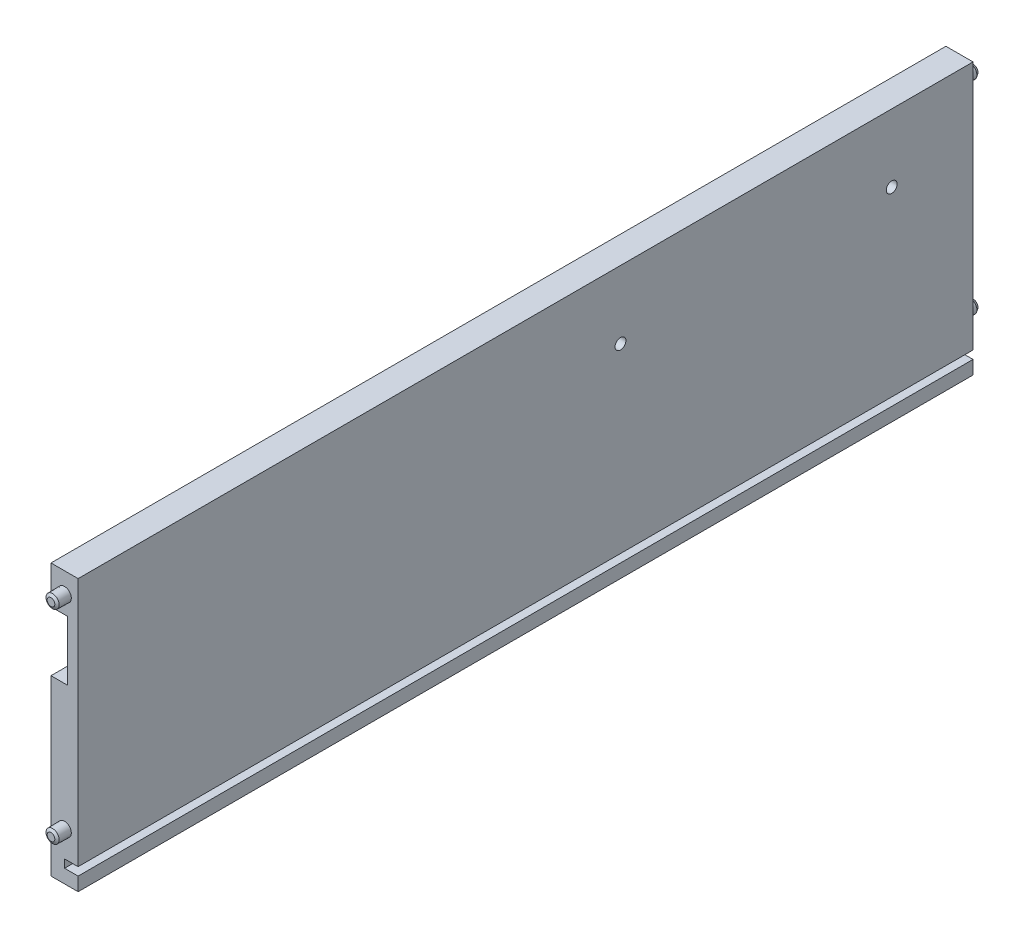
from build123d import *
from OCP.BRepFilletAPI import BRepFilletAPI_MakeChamfer

# Parameters (mm, degrees)
SKETCH1_W                     = 330
SKETCH1_H                     = 100
BOSS_EXTRUDE1_DEPTH           = 10
SKETCH2_W                     = 330
SKETCH2_H                     = 22
CUT_EXTRUDE1_DEPTH            = 6
SKETCH3_R                     = 2
CUT_EXTRUDE2_DEPTH            = 10
SKETCH4_R                     = 2.5
BOSS_EXTRUDE2_DEPTH           = 5
BOSS_EXTRUDE2_DRAFT           = 1
BOSS_EXTRUDE2_PROFILE_2_DEPTH = 5
BOSS_EXTRUDE2_PROFILE_2_DRAFT = 1
MIRROR1_COPY_1_SKETCH_R       = 2.5
MIRROR1_COPY_1_DEPTH          = 5
MIRROR1_COPY_1_DRAFT          = 1
MIRROR1_COPY_2_SKETCH_R       = 2.5
MIRROR1_COPY_2_DEPTH          = 5
MIRROR1_COPY_2_DRAFT          = 1
MIRROR1_COPY_3_SKETCH_R       = 2.5
MIRROR1_COPY_3_DEPTH          = 5
MIRROR1_COPY_3_DRAFT          = 1
CHAMFER1_SIZE                 = 1
CHAMFER1_SIZE2                = 0.583316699
SKETCH5_W                     = 330
SKETCH5_H                     = 3
CUT_EXTRUDE3_DEPTH            = 5


with BuildPart() as part:
    # Sketch1 → Boss-Extrude1 (new body)
    with BuildSketch(Plane(origin=(0, 0, 0), x_dir=(0, 0, -1), z_dir=(1, 0, 0))):
        Rectangle(SKETCH1_W, SKETCH1_H)
    extrude(amount=BOSS_EXTRUDE1_DEPTH)

    # Sketch2 → Cut-Extrude1 (cut)
    with BuildSketch(Plane.ZY):
        with Locations((0, 25)):
            Rectangle(SKETCH2_W, SKETCH2_H)
    extrude(amount=-CUT_EXTRUDE1_DEPTH, mode=Mode.SUBTRACT)

    # Sketch3 → Cut-Extrude2 (cut)
    with BuildSketch(Plane.ZY.offset(-6)):
        with Locations((-135, 25)):
            Circle(SKETCH3_R)
        with Locations((-35, 25)):
            Circle(SKETCH3_R)
    extrude(amount=-CUT_EXTRUDE2_DEPTH, mode=Mode.SUBTRACT)


with BuildPart() as boss_extrude2_tool:
    # Sketch4 → Boss-Extrude2 (with draft: the straight prism first)
    with BuildSketch(Plane(origin=(0, 0, -165), x_dir=(-1, 0, 0), z_dir=(0, 0, -1))):
        with Locations((-5, 42.5)):
            Circle(SKETCH4_R)
    extrude(amount=BOSS_EXTRUDE2_DEPTH)
    # Boss-Extrude2: the draft: its side faces are tilted about the plane it starts from
    boss_extrude2_sides = [boss_extrude2_tool.faces().sort_by_distance(p)[0] for p in [
        (7.5, 42.5, -167.5),
    ]]
    draft(boss_extrude2_sides, Plane(origin=(0, 0, -165), x_dir=(-1, 0, 0), z_dir=(0, 0, -1)), BOSS_EXTRUDE2_DRAFT)


with BuildPart() as part_1:
    add(part.part)

    # Boss-Extrude2: add boss_extrude2_tool
    add(boss_extrude2_tool.part)


with BuildPart() as boss_extrude2_profile_2_tool:
    # Sketch4 → Boss-Extrude2 profile 2 (with draft: the straight prism first)
    with BuildSketch(Plane(origin=(0, 0, -165), x_dir=(-1, 0, 0), z_dir=(0, 0, -1))):
        with Locations((-5, -32.5)):
            Circle(SKETCH4_R)
    extrude(amount=BOSS_EXTRUDE2_PROFILE_2_DEPTH)
    # Boss-Extrude2 profile 2: the draft: its side faces are tilted about the plane it starts from
    boss_extrude2_profile_2_sides = [boss_extrude2_profile_2_tool.faces().sort_by_distance(p)[0] for p in [
        (7.5, -32.5, -167.5),
    ]]
    draft(boss_extrude2_profile_2_sides, Plane(origin=(0, 0, -165), x_dir=(-1, 0, 0), z_dir=(0, 0, -1)), BOSS_EXTRUDE2_PROFILE_2_DRAFT)


with BuildPart() as part_2:
    add(part_1.part)

    # Boss-Extrude2 profile 2: add boss_extrude2_profile_2_tool
    add(boss_extrude2_profile_2_tool.part)


with BuildPart() as mirror1_copy_1_tool:
    # Mirror1 copy 1 sketch → Mirror1 copy 1 (with draft: the straight prism first)
    with BuildSketch(Plane(origin=(0, 0, 165), x_dir=(-1, 0, 0), z_dir=(0, 0, 1))):
        with Locations((-5, -42.5)):
            Circle(MIRROR1_COPY_1_SKETCH_R)
    extrude(amount=MIRROR1_COPY_1_DEPTH)
    # Mirror1 copy 1: the draft: its side faces are tilted about the plane it starts from
    mirror1_copy_1_sides = [mirror1_copy_1_tool.faces().sort_by_distance(p)[0] for p in [
        (7.5, 42.5, 167.5),
    ]]
    draft(mirror1_copy_1_sides, Plane(origin=(0, 0, 165), x_dir=(-1, 0, 0), z_dir=(0, 0, 1)), MIRROR1_COPY_1_DRAFT)


with BuildPart() as part_3:
    add(part_2.part)

    # Mirror1 copy 1: add mirror1_copy_1_tool
    add(mirror1_copy_1_tool.part)


with BuildPart() as mirror1_copy_2_tool:
    # Mirror1 copy 2 sketch → Mirror1 copy 2 (with draft: the straight prism first)
    with BuildSketch(Plane(origin=(0, 0, 165), x_dir=(-1, 0, 0), z_dir=(0, 0, 1))):
        with Locations((-5, 32.5)):
            Circle(MIRROR1_COPY_2_SKETCH_R)
    extrude(amount=MIRROR1_COPY_2_DEPTH)
    # Mirror1 copy 2: the draft: its side faces are tilted about the plane it starts from
    mirror1_copy_2_sides = [mirror1_copy_2_tool.faces().sort_by_distance(p)[0] for p in [
        (7.5, -32.5, 167.5),
    ]]
    draft(mirror1_copy_2_sides, Plane(origin=(0, 0, 165), x_dir=(-1, 0, 0), z_dir=(0, 0, 1)), MIRROR1_COPY_2_DRAFT)


with BuildPart() as part_4:
    add(part_3.part)

    # Mirror1 copy 2: add mirror1_copy_2_tool
    add(mirror1_copy_2_tool.part)


with BuildPart() as mirror1_copy_3_tool:
    # Mirror1 copy 3 sketch → Mirror1 copy 3 (with draft: the straight prism first)
    with BuildSketch(Plane(origin=(0, 0, 165), x_dir=(-1, 0, 0), z_dir=(0, 0, 1))):
        with Locations((-5, 32.5)):
            Circle(MIRROR1_COPY_3_SKETCH_R)
    extrude(amount=MIRROR1_COPY_3_DEPTH)
    # Mirror1 copy 3: the draft: its side faces are tilted about the plane it starts from
    mirror1_copy_3_sides = [mirror1_copy_3_tool.faces().sort_by_distance(p)[0] for p in [
        (7.5, -32.5, 167.5),
    ]]
    draft(mirror1_copy_3_sides, Plane(origin=(0, 0, 165), x_dir=(-1, 0, 0), z_dir=(0, 0, 1)), MIRROR1_COPY_3_DRAFT)


with BuildPart() as part_5:
    add(part_4.part)

    # Mirror1 copy 3: add mirror1_copy_3_tool
    add(mirror1_copy_3_tool.part)

    # Chamfer1: one chamfer whose edges measure the first distance from different faces: ONE call of the kernel's chamfer builder (chamfer() names one face for all edges)
    chamfer1_edges_1 = [part_5.edges().sort_by_distance(p)[0] for p in [
        (7.412724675, 42.5, -170),
    ]]
    chamfer1_side_1 = [part_5.faces().sort_by_distance(p)[0] for p in [
        (7.456362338, 42.5, -167.5),
    ]]
    chamfer1_edges_2 = [part_5.edges().sort_by_distance(p)[0] for p in [
        (7.412724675, -32.5, -170),
    ]]
    chamfer1_side_2 = [part_5.faces().sort_by_distance(p)[0] for p in [
        (7.456362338, -32.5, -167.5),
    ]]
    chamfer1_edges_3 = [part_5.edges().sort_by_distance(p)[0] for p in [
        (7.412724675, 42.5, 170),
    ]]
    chamfer1_side_3 = [part_5.faces().sort_by_distance(p)[0] for p in [
        (5, 42.5, 170),
    ]]
    chamfer1_edges_4 = [part_5.edges().sort_by_distance(p)[0] for p in [
        (7.412724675, -32.5, 170),
    ]]
    chamfer1_side_4 = [part_5.faces().sort_by_distance(p)[0] for p in [
        (5, -32.5, 170),
    ]]
    chamfer1 = BRepFilletAPI_MakeChamfer(part_5.part.solid().wrapped)
    for e in chamfer1_edges_1:
        chamfer1.Add(CHAMFER1_SIZE, CHAMFER1_SIZE2, e.wrapped, chamfer1_side_1[0].wrapped)  # the first distance lies on this face
    for e in chamfer1_edges_2:
        chamfer1.Add(CHAMFER1_SIZE, CHAMFER1_SIZE2, e.wrapped, chamfer1_side_2[0].wrapped)  # the first distance lies on this face
    for e in chamfer1_edges_3:
        chamfer1.Add(CHAMFER1_SIZE, CHAMFER1_SIZE2, e.wrapped, chamfer1_side_3[0].wrapped)  # the first distance lies on this face
    for e in chamfer1_edges_4:
        chamfer1.Add(CHAMFER1_SIZE, CHAMFER1_SIZE2, e.wrapped, chamfer1_side_4[0].wrapped)  # the first distance lies on this face
    add(Compound.cast(chamfer1.Shape()), mode=Mode.REPLACE)

    # Sketch5 → Cut-Extrude3 (cut)
    with BuildSketch(Plane(origin=(10, 0, 0), x_dir=(0, 0, -1), z_dir=(1, 0, 0))):
        with Locations((0, -43.5)):
            Rectangle(SKETCH5_W, SKETCH5_H)
    extrude(amount=-CUT_EXTRUDE3_DEPTH, mode=Mode.SUBTRACT)


solid = part_5.part
